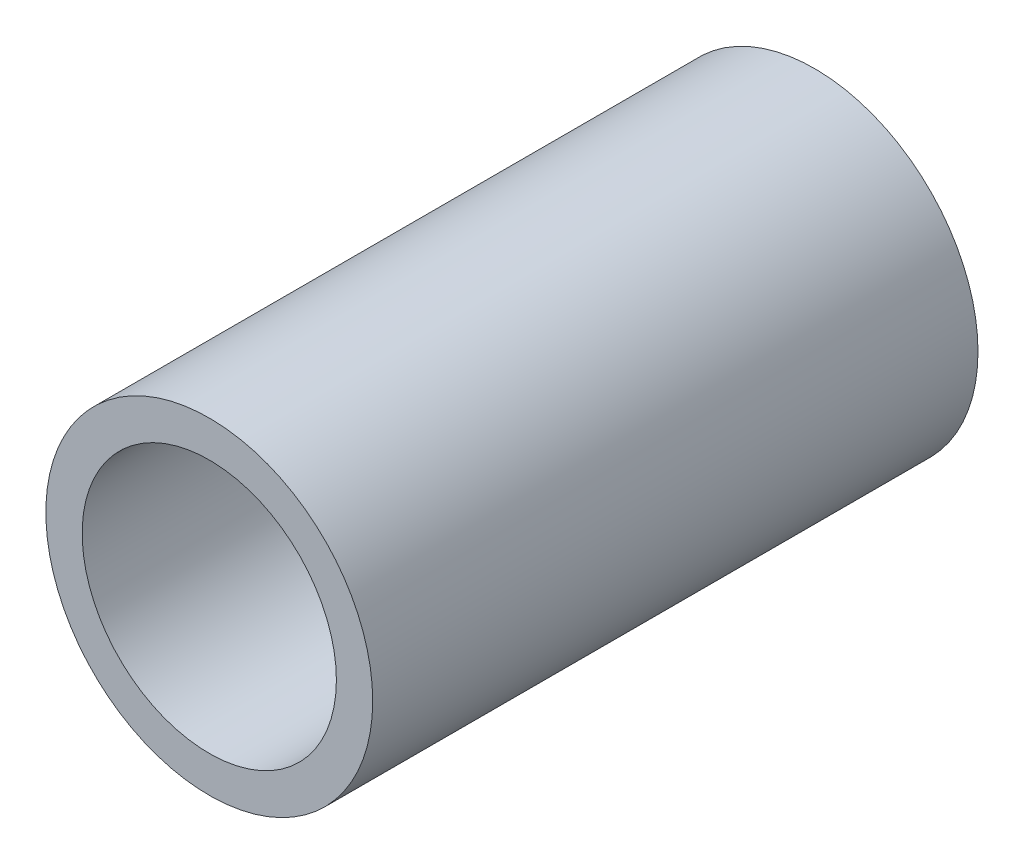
from build123d import *

# Parameters (mm, degrees)
ESQUISSE1_R        = 13.5
ESQUISSE1_R_2      = 10.5
EXTRU_MINCE1_DEPTH = 50


with BuildPart() as part:
    # Esquisse1 → Extru.-Mince1 (new body)
    with BuildSketch(Plane.XY):
        Circle(ESQUISSE1_R)
        Circle(ESQUISSE1_R_2, mode=Mode.SUBTRACT)
    extrude(amount=EXTRU_MINCE1_DEPTH)


solid = part.part
